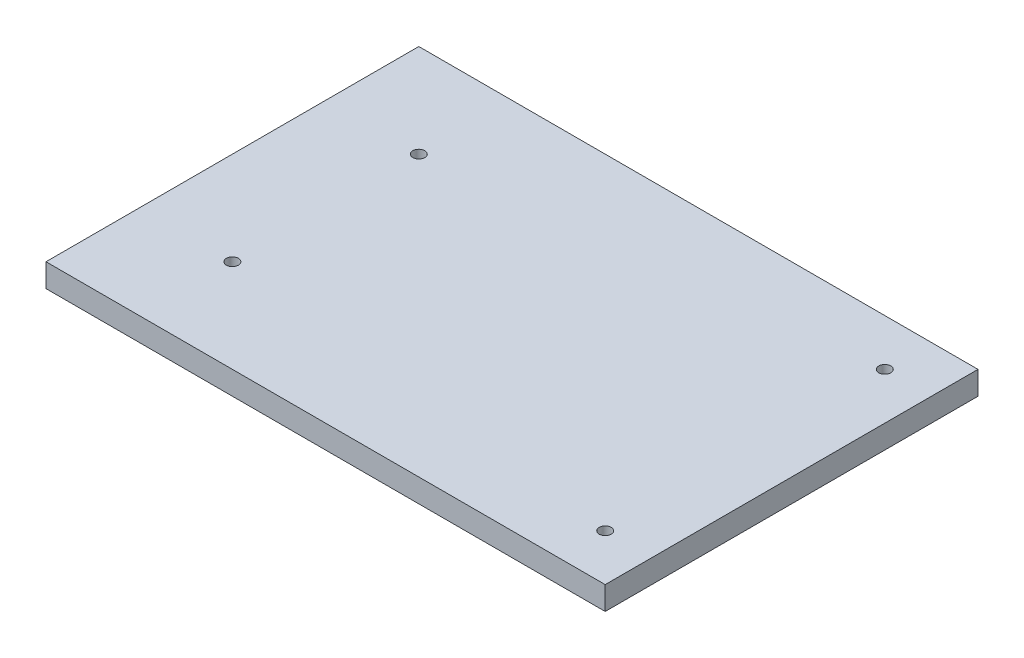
ISO-10303-21;
HEADER;
FILE_DESCRIPTION(('STEP AP214'),'2;1');
FILE_NAME('part.step','',(''),(''),'','','');
FILE_SCHEMA(('AUTOMOTIVE_DESIGN { 1 0 10303 214 1 1 1 1 }'));
ENDSEC;
DATA;
#1=APPLICATION_CONTEXT('core data for automotive mechanical design processes');
#2=APPLICATION_PROTOCOL_DEFINITION('international standard','automotive_design',2000,#1);
#3=PRODUCT_CONTEXT('',#1,'mechanical');
#4=PRODUCT('Part','Part','',(#3));
#5=PRODUCT_RELATED_PRODUCT_CATEGORY('part','',(#4));
#6=PRODUCT_DEFINITION_FORMATION('','',#4);
#7=PRODUCT_DEFINITION_CONTEXT('part definition',#1,'design');
#8=PRODUCT_DEFINITION('design','',#6,#7);
#9=PRODUCT_DEFINITION_SHAPE('','',#8);
#10=(LENGTH_UNIT() NAMED_UNIT(*) SI_UNIT(.MILLI.,.METRE.));
#11=(NAMED_UNIT(*) PLANE_ANGLE_UNIT() SI_UNIT($,.RADIAN.));
#12=(NAMED_UNIT(*) SI_UNIT($,.STERADIAN.) SOLID_ANGLE_UNIT());
#13=UNCERTAINTY_MEASURE_WITH_UNIT(LENGTH_MEASURE(1.E-05),#10,'distance_accuracy_value','');
#14=(GEOMETRIC_REPRESENTATION_CONTEXT(3) GLOBAL_UNCERTAINTY_ASSIGNED_CONTEXT((#13)) GLOBAL_UNIT_ASSIGNED_CONTEXT((#10,
#11,#12)) REPRESENTATION_CONTEXT('',''));
#15=CARTESIAN_POINT('',(0.,0.,0.));
#16=DIRECTION('',(0.,0.,1.));
#17=DIRECTION('',(1.,0.,0.));
#18=AXIS2_PLACEMENT_3D('',#15,#16,#17);
#19=CARTESIAN_POINT('',(-168.181435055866,6.35,-43.909717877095));
#20=DIRECTION('',(1.,0.,0.));
#21=DIRECTION('',(0.,0.,-1.));
#22=AXIS2_PLACEMENT_3D('',#19,#20,#21);
#23=PLANE('',#22);
#24=DIRECTION('',(0.,0.,1.));
#25=VECTOR('',#24,1.);
#26=CARTESIAN_POINT('',(-168.181435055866,0.,-43.909717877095));
#27=LINE('',#26,#25);
#28=CARTESIAN_POINT('',(-168.181435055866,0.,-43.909717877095));
#29=VERTEX_POINT('',#28);
#30=CARTESIAN_POINT('',(-168.181435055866,0.,57.690282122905));
#31=VERTEX_POINT('',#30);
#32=EDGE_CURVE('E96',#29,#31,#27,.T.);
#33=ORIENTED_EDGE('',*,*,#32,.T.);
#34=DIRECTION('',(0.,-1.,0.));
#35=VECTOR('',#34,1.);
#36=CARTESIAN_POINT('',(-168.181435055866,6.35,57.690282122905));
#37=LINE('',#36,#35);
#38=CARTESIAN_POINT('',(-168.181435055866,6.35,57.690282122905));
#39=VERTEX_POINT('',#38);
#40=EDGE_CURVE('E11',#39,#31,#37,.T.);
#41=ORIENTED_EDGE('',*,*,#40,.F.);
#42=DIRECTION('',(0.,0.,1.));
#43=VECTOR('',#42,1.);
#44=CARTESIAN_POINT('',(-168.181435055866,6.35,-43.909717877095));
#45=LINE('',#44,#43);
#46=CARTESIAN_POINT('',(-168.181435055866,6.35,-43.909717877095));
#47=VERTEX_POINT('',#46);
#48=EDGE_CURVE('E83',#47,#39,#45,.T.);
#49=ORIENTED_EDGE('',*,*,#48,.F.);
#50=DIRECTION('',(0.,-1.,0.));
#51=VECTOR('',#50,1.);
#52=CARTESIAN_POINT('',(-168.181435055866,6.35,-43.909717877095));
#53=LINE('',#52,#51);
#54=EDGE_CURVE('E92',#47,#29,#53,.T.);
#55=ORIENTED_EDGE('',*,*,#54,.T.);
#56=EDGE_LOOP('',(#33,#41,#49,#55));
#57=FACE_BOUND('',#56,.T.);
#58=ADVANCED_FACE('F30',(#57),#23,.F.);
#59=CARTESIAN_POINT('',(-168.181435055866,6.35,57.690282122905));
#60=DIRECTION('',(0.,0.,-1.));
#61=DIRECTION('',(-1.,0.,0.));
#62=AXIS2_PLACEMENT_3D('',#59,#60,#61);
#63=PLANE('',#62);
#64=DIRECTION('',(1.,0.,0.));
#65=VECTOR('',#64,1.);
#66=CARTESIAN_POINT('',(-168.181435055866,0.,57.690282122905));
#67=LINE('',#66,#65);
#68=CARTESIAN_POINT('',(-15.7814350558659,0.,57.690282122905));
#69=VERTEX_POINT('',#68);
#70=EDGE_CURVE('E87',#31,#69,#67,.T.);
#71=ORIENTED_EDGE('',*,*,#70,.T.);
#72=DIRECTION('',(0.,-1.,0.));
#73=VECTOR('',#72,1.);
#74=CARTESIAN_POINT('',(-15.7814350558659,6.35,57.690282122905));
#75=LINE('',#74,#73);
#76=CARTESIAN_POINT('',(-15.7814350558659,6.35,57.690282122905));
#77=VERTEX_POINT('',#76);
#78=EDGE_CURVE('E39',#77,#69,#75,.T.);
#79=ORIENTED_EDGE('',*,*,#78,.F.);
#80=DIRECTION('',(1.,0.,0.));
#81=VECTOR('',#80,1.);
#82=CARTESIAN_POINT('',(-168.181435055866,6.35,57.690282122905));
#83=LINE('',#82,#81);
#84=EDGE_CURVE('E78',#39,#77,#83,.T.);
#85=ORIENTED_EDGE('',*,*,#84,.F.);
#86=ORIENTED_EDGE('',*,*,#40,.T.);
#87=EDGE_LOOP('',(#71,#79,#85,#86));
#88=FACE_BOUND('',#87,.T.);
#89=ADVANCED_FACE('F86',(#88),#63,.F.);
#90=CARTESIAN_POINT('',(-15.7814350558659,6.35,-43.909717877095));
#91=DIRECTION('',(-1.,0.,0.));
#92=DIRECTION('',(0.,0.,1.));
#93=AXIS2_PLACEMENT_3D('',#90,#91,#92);
#94=PLANE('',#93);
#95=DIRECTION('',(0.,0.,-1.));
#96=VECTOR('',#95,1.);
#97=CARTESIAN_POINT('',(-15.7814350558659,0.,-43.909717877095));
#98=LINE('',#97,#96);
#99=CARTESIAN_POINT('',(-15.7814350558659,0.,-43.909717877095));
#100=VERTEX_POINT('',#99);
#101=EDGE_CURVE('E65',#69,#100,#98,.T.);
#102=ORIENTED_EDGE('',*,*,#101,.T.);
#103=DIRECTION('',(0.,-1.,0.));
#104=VECTOR('',#103,1.);
#105=CARTESIAN_POINT('',(-15.7814350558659,6.35,-43.909717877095));
#106=LINE('',#105,#104);
#107=CARTESIAN_POINT('',(-15.7814350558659,6.35,-43.909717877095));
#108=VERTEX_POINT('',#107);
#109=EDGE_CURVE('E88',#108,#100,#106,.T.);
#110=ORIENTED_EDGE('',*,*,#109,.F.);
#111=DIRECTION('',(0.,0.,-1.));
#112=VECTOR('',#111,1.);
#113=CARTESIAN_POINT('',(-15.7814350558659,6.35,-43.909717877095));
#114=LINE('',#113,#112);
#115=EDGE_CURVE('E81',#77,#108,#114,.T.);
#116=ORIENTED_EDGE('',*,*,#115,.F.);
#117=ORIENTED_EDGE('',*,*,#78,.T.);
#118=EDGE_LOOP('',(#102,#110,#116,#117));
#119=FACE_BOUND('',#118,.T.);
#120=ADVANCED_FACE('F90',(#119),#94,.F.);
#121=CARTESIAN_POINT('',(-168.181435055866,6.35,-43.909717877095));
#122=DIRECTION('',(0.,0.,1.));
#123=DIRECTION('',(1.,0.,0.));
#124=AXIS2_PLACEMENT_3D('',#121,#122,#123);
#125=PLANE('',#124);
#126=DIRECTION('',(-1.,0.,0.));
#127=VECTOR('',#126,1.);
#128=CARTESIAN_POINT('',(-168.181435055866,0.,-43.909717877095));
#129=LINE('',#128,#127);
#130=EDGE_CURVE('E71',#100,#29,#129,.T.);
#131=ORIENTED_EDGE('',*,*,#130,.T.);
#132=ORIENTED_EDGE('',*,*,#54,.F.);
#133=DIRECTION('',(-1.,0.,0.));
#134=VECTOR('',#133,1.);
#135=CARTESIAN_POINT('',(-168.181435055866,6.35,-43.909717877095));
#136=LINE('',#135,#134);
#137=EDGE_CURVE('E48',#108,#47,#136,.T.);
#138=ORIENTED_EDGE('',*,*,#137,.F.);
#139=ORIENTED_EDGE('',*,*,#109,.T.);
#140=EDGE_LOOP('',(#131,#132,#138,#139));
#141=FACE_BOUND('',#140,.T.);
#142=ADVANCED_FACE('F134',(#141),#125,.F.);
#143=CARTESIAN_POINT('',(-168.181435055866,6.35,57.690282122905));
#144=DIRECTION('',(0.,1.,0.));
#145=DIRECTION('',(0.,0.,1.));
#146=AXIS2_PLACEMENT_3D('',#143,#144,#145);
#147=PLANE('',#146);
#148=CARTESIAN_POINT('',(-142.781435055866,6.35,-18.509717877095));
#149=DIRECTION('',(0.,1.,0.));
#150=DIRECTION('',(0.,0.,1.));
#151=AXIS2_PLACEMENT_3D('',#148,#149,#150);
#152=CIRCLE('',#151,1.63194999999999);
#153=CARTESIAN_POINT('',(-142.781435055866,6.35,-16.877767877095));
#154=VERTEX_POINT('',#153);
#155=EDGE_CURVE('E123',#154,#154,#152,.T.);
#156=ORIENTED_EDGE('',*,*,#155,.F.);
#157=EDGE_LOOP('',(#156));
#158=FACE_BOUND('',#157,.T.);
#159=CARTESIAN_POINT('',(-142.781435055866,6.35,32.290282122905));
#160=DIRECTION('',(0.,1.,0.));
#161=DIRECTION('',(0.,0.,1.));
#162=AXIS2_PLACEMENT_3D('',#159,#160,#161);
#163=CIRCLE('',#162,1.63194999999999);
#164=CARTESIAN_POINT('',(-142.781435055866,6.35,33.922232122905));
#165=VERTEX_POINT('',#164);
#166=EDGE_CURVE('E113',#165,#165,#163,.T.);
#167=ORIENTED_EDGE('',*,*,#166,.F.);
#168=EDGE_LOOP('',(#167));
#169=FACE_BOUND('',#168,.T.);
#170=CARTESIAN_POINT('',(-28.4814350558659,6.35,44.990282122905));
#171=DIRECTION('',(0.,1.,0.));
#172=DIRECTION('',(0.,0.,1.));
#173=AXIS2_PLACEMENT_3D('',#170,#171,#172);
#174=CIRCLE('',#173,1.63194999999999);
#175=CARTESIAN_POINT('',(-28.4814350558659,6.35,46.622232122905));
#176=VERTEX_POINT('',#175);
#177=EDGE_CURVE('E110',#176,#176,#174,.T.);
#178=ORIENTED_EDGE('',*,*,#177,.F.);
#179=EDGE_LOOP('',(#178));
#180=FACE_BOUND('',#179,.T.);
#181=CARTESIAN_POINT('',(-28.4814350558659,6.35,-31.209717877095));
#182=DIRECTION('',(0.,1.,0.));
#183=DIRECTION('',(0.,0.,1.));
#184=AXIS2_PLACEMENT_3D('',#181,#182,#183);
#185=CIRCLE('',#184,1.63194999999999);
#186=CARTESIAN_POINT('',(-28.4814350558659,6.35,-29.577767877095));
#187=VERTEX_POINT('',#186);
#188=EDGE_CURVE('E107',#187,#187,#185,.T.);
#189=ORIENTED_EDGE('',*,*,#188,.F.);
#190=EDGE_LOOP('',(#189));
#191=FACE_BOUND('',#190,.T.);
#192=ORIENTED_EDGE('',*,*,#48,.T.);
#193=ORIENTED_EDGE('',*,*,#84,.T.);
#194=ORIENTED_EDGE('',*,*,#115,.T.);
#195=ORIENTED_EDGE('',*,*,#137,.T.);
#196=EDGE_LOOP('',(#192,#193,#194,#195));
#197=FACE_BOUND('',#196,.T.);
#198=ADVANCED_FACE('F79',(#158,#169,#180,#191,#197),#147,.T.);
#199=CARTESIAN_POINT('',(-168.181435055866,0.,57.690282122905));
#200=DIRECTION('',(0.,1.,0.));
#201=DIRECTION('',(0.,0.,1.));
#202=AXIS2_PLACEMENT_3D('',#199,#200,#201);
#203=PLANE('',#202);
#204=CARTESIAN_POINT('',(-142.781435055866,0.,-18.509717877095));
#205=DIRECTION('',(0.,1.,0.));
#206=DIRECTION('',(0.,0.,1.));
#207=AXIS2_PLACEMENT_3D('',#204,#205,#206);
#208=CIRCLE('',#207,1.63194999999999);
#209=CARTESIAN_POINT('',(-142.781435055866,0.,-16.877767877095));
#210=VERTEX_POINT('',#209);
#211=EDGE_CURVE('E33',#210,#210,#208,.T.);
#212=ORIENTED_EDGE('',*,*,#211,.T.);
#213=EDGE_LOOP('',(#212));
#214=FACE_BOUND('',#213,.T.);
#215=CARTESIAN_POINT('',(-142.781435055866,0.,32.290282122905));
#216=DIRECTION('',(0.,1.,0.));
#217=DIRECTION('',(0.,0.,1.));
#218=AXIS2_PLACEMENT_3D('',#215,#216,#217);
#219=CIRCLE('',#218,1.63194999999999);
#220=CARTESIAN_POINT('',(-142.781435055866,0.,33.922232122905));
#221=VERTEX_POINT('',#220);
#222=EDGE_CURVE('E111',#221,#221,#219,.T.);
#223=ORIENTED_EDGE('',*,*,#222,.T.);
#224=EDGE_LOOP('',(#223));
#225=FACE_BOUND('',#224,.T.);
#226=CARTESIAN_POINT('',(-28.4814350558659,0.,44.990282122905));
#227=DIRECTION('',(0.,1.,0.));
#228=DIRECTION('',(0.,0.,1.));
#229=AXIS2_PLACEMENT_3D('',#226,#227,#228);
#230=CIRCLE('',#229,1.63194999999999);
#231=CARTESIAN_POINT('',(-28.4814350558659,0.,46.622232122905));
#232=VERTEX_POINT('',#231);
#233=EDGE_CURVE('E108',#232,#232,#230,.T.);
#234=ORIENTED_EDGE('',*,*,#233,.T.);
#235=EDGE_LOOP('',(#234));
#236=FACE_BOUND('',#235,.T.);
#237=CARTESIAN_POINT('',(-28.4814350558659,0.,-31.209717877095));
#238=DIRECTION('',(0.,1.,0.));
#239=DIRECTION('',(0.,0.,1.));
#240=AXIS2_PLACEMENT_3D('',#237,#238,#239);
#241=CIRCLE('',#240,1.63194999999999);
#242=CARTESIAN_POINT('',(-28.4814350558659,0.,-29.577767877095));
#243=VERTEX_POINT('',#242);
#244=EDGE_CURVE('E99',#243,#243,#241,.T.);
#245=ORIENTED_EDGE('',*,*,#244,.T.);
#246=EDGE_LOOP('',(#245));
#247=FACE_BOUND('',#246,.T.);
#248=ORIENTED_EDGE('',*,*,#32,.F.);
#249=ORIENTED_EDGE('',*,*,#130,.F.);
#250=ORIENTED_EDGE('',*,*,#101,.F.);
#251=ORIENTED_EDGE('',*,*,#70,.F.);
#252=EDGE_LOOP('',(#248,#249,#250,#251));
#253=FACE_BOUND('',#252,.T.);
#254=ADVANCED_FACE('F133',(#214,#225,#236,#247,#253),#203,.F.);
#255=CARTESIAN_POINT('',(-28.4814350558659,6.35,-31.209717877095));
#256=DIRECTION('',(0.,1.,0.));
#257=DIRECTION('',(0.,0.,1.));
#258=AXIS2_PLACEMENT_3D('',#255,#256,#257);
#259=CYLINDRICAL_SURFACE('',#258,1.63194999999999);
#260=ORIENTED_EDGE('',*,*,#188,.T.);
#261=EDGE_LOOP('',(#260));
#262=FACE_BOUND('',#261,.T.);
#263=ORIENTED_EDGE('',*,*,#244,.F.);
#264=EDGE_LOOP('',(#263));
#265=FACE_BOUND('',#264,.T.);
#266=ADVANCED_FACE('F129',(#262,#265),#259,.F.);
#267=CARTESIAN_POINT('',(-28.4814350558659,6.35,44.990282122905));
#268=DIRECTION('',(0.,1.,0.));
#269=DIRECTION('',(0.,0.,1.));
#270=AXIS2_PLACEMENT_3D('',#267,#268,#269);
#271=CYLINDRICAL_SURFACE('',#270,1.63194999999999);
#272=ORIENTED_EDGE('',*,*,#177,.T.);
#273=EDGE_LOOP('',(#272));
#274=FACE_BOUND('',#273,.T.);
#275=ORIENTED_EDGE('',*,*,#233,.F.);
#276=EDGE_LOOP('',(#275));
#277=FACE_BOUND('',#276,.T.);
#278=ADVANCED_FACE('F183',(#274,#277),#271,.F.);
#279=CARTESIAN_POINT('',(-142.781435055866,6.35,32.290282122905));
#280=DIRECTION('',(0.,1.,0.));
#281=DIRECTION('',(0.,0.,1.));
#282=AXIS2_PLACEMENT_3D('',#279,#280,#281);
#283=CYLINDRICAL_SURFACE('',#282,1.63194999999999);
#284=ORIENTED_EDGE('',*,*,#166,.T.);
#285=EDGE_LOOP('',(#284));
#286=FACE_BOUND('',#285,.T.);
#287=ORIENTED_EDGE('',*,*,#222,.F.);
#288=EDGE_LOOP('',(#287));
#289=FACE_BOUND('',#288,.T.);
#290=ADVANCED_FACE('F191',(#286,#289),#283,.F.);
#291=CARTESIAN_POINT('',(-142.781435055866,6.35,-18.509717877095));
#292=DIRECTION('',(0.,1.,0.));
#293=DIRECTION('',(0.,0.,1.));
#294=AXIS2_PLACEMENT_3D('',#291,#292,#293);
#295=CYLINDRICAL_SURFACE('',#294,1.63194999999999);
#296=ORIENTED_EDGE('',*,*,#155,.T.);
#297=EDGE_LOOP('',(#296));
#298=FACE_BOUND('',#297,.T.);
#299=ORIENTED_EDGE('',*,*,#211,.F.);
#300=EDGE_LOOP('',(#299));
#301=FACE_BOUND('',#300,.T.);
#302=ADVANCED_FACE('F201',(#298,#301),#295,.F.);
#303=CLOSED_SHELL('',(#58,#89,#120,#142,#198,#254,#266,#278,#290,#302));
#304=MANIFOLD_SOLID_BREP('B2',#303);
#305=ADVANCED_BREP_SHAPE_REPRESENTATION('',(#18,#304),#14);
#306=SHAPE_DEFINITION_REPRESENTATION(#9,#305);
ENDSEC;
END-ISO-10303-21;
